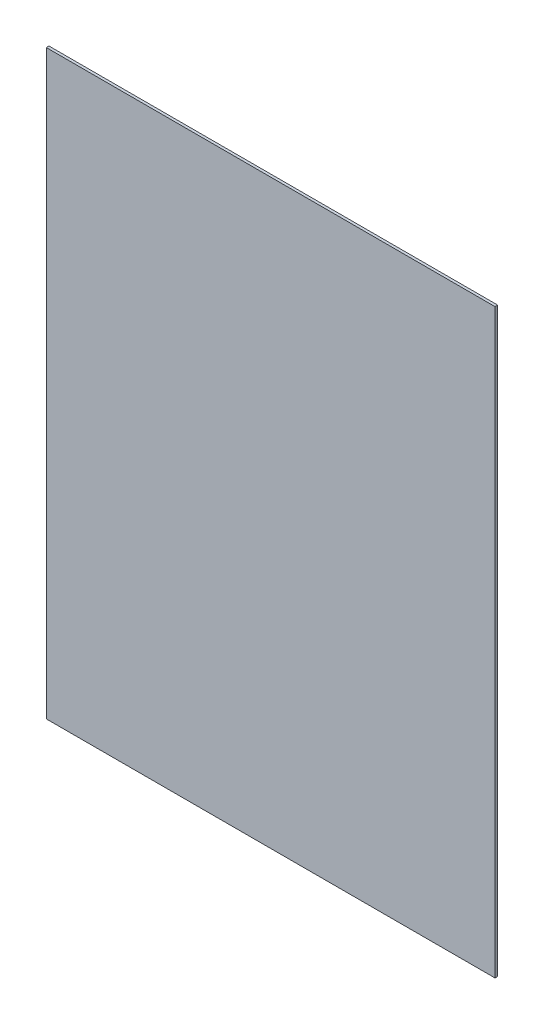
ISO-10303-21;
HEADER;
FILE_DESCRIPTION(('STEP AP214'),'2;1');
FILE_NAME('part.step','',(''),(''),'','','');
FILE_SCHEMA(('AUTOMOTIVE_DESIGN { 1 0 10303 214 1 1 1 1 }'));
ENDSEC;
DATA;
#1=APPLICATION_CONTEXT('core data for automotive mechanical design processes');
#2=APPLICATION_PROTOCOL_DEFINITION('international standard','automotive_design',2000,#1);
#3=PRODUCT_CONTEXT('',#1,'mechanical');
#4=PRODUCT('Part','Part','',(#3));
#5=PRODUCT_RELATED_PRODUCT_CATEGORY('part','',(#4));
#6=PRODUCT_DEFINITION_FORMATION('','',#4);
#7=PRODUCT_DEFINITION_CONTEXT('part definition',#1,'design');
#8=PRODUCT_DEFINITION('design','',#6,#7);
#9=PRODUCT_DEFINITION_SHAPE('','',#8);
#10=(LENGTH_UNIT() NAMED_UNIT(*) SI_UNIT(.MILLI.,.METRE.));
#11=(NAMED_UNIT(*) PLANE_ANGLE_UNIT() SI_UNIT($,.RADIAN.));
#12=(NAMED_UNIT(*) SI_UNIT($,.STERADIAN.) SOLID_ANGLE_UNIT());
#13=UNCERTAINTY_MEASURE_WITH_UNIT(LENGTH_MEASURE(1.E-05),#10,'distance_accuracy_value','');
#14=(GEOMETRIC_REPRESENTATION_CONTEXT(3) GLOBAL_UNCERTAINTY_ASSIGNED_CONTEXT((#13)) GLOBAL_UNIT_ASSIGNED_CONTEXT((#10,
#11,#12)) REPRESENTATION_CONTEXT('',''));
#15=CARTESIAN_POINT('',(0.,0.,0.));
#16=DIRECTION('',(0.,0.,1.));
#17=DIRECTION('',(1.,0.,0.));
#18=AXIS2_PLACEMENT_3D('',#15,#16,#17);
#19=CARTESIAN_POINT('',(0.,0.,3.));
#20=DIRECTION('',(1.,0.,0.));
#21=DIRECTION('',(0.,0.,-1.));
#22=AXIS2_PLACEMENT_3D('',#19,#20,#21);
#23=PLANE('',#22);
#24=DIRECTION('',(0.,-1.,0.));
#25=VECTOR('',#24,1.);
#26=CARTESIAN_POINT('',(0.,0.,0.));
#27=LINE('',#26,#25);
#28=CARTESIAN_POINT('',(0.,655.,0.));
#29=VERTEX_POINT('',#28);
#30=CARTESIAN_POINT('',(0.,0.,0.));
#31=VERTEX_POINT('',#30);
#32=EDGE_CURVE('E113',#29,#31,#27,.T.);
#33=ORIENTED_EDGE('',*,*,#32,.T.);
#34=DIRECTION('',(0.,0.,-1.));
#35=VECTOR('',#34,1.);
#36=CARTESIAN_POINT('',(0.,0.,3.));
#37=LINE('',#36,#35);
#38=CARTESIAN_POINT('',(0.,0.,3.));
#39=VERTEX_POINT('',#38);
#40=EDGE_CURVE('E11',#39,#31,#37,.T.);
#41=ORIENTED_EDGE('',*,*,#40,.F.);
#42=DIRECTION('',(0.,-1.,0.));
#43=VECTOR('',#42,1.);
#44=CARTESIAN_POINT('',(0.,0.,3.));
#45=LINE('',#44,#43);
#46=CARTESIAN_POINT('',(0.,655.,3.));
#47=VERTEX_POINT('',#46);
#48=EDGE_CURVE('E97',#47,#39,#45,.T.);
#49=ORIENTED_EDGE('',*,*,#48,.F.);
#50=DIRECTION('',(0.,0.,-1.));
#51=VECTOR('',#50,1.);
#52=CARTESIAN_POINT('',(0.,655.,3.));
#53=LINE('',#52,#51);
#54=EDGE_CURVE('E109',#47,#29,#53,.T.);
#55=ORIENTED_EDGE('',*,*,#54,.T.);
#56=EDGE_LOOP('',(#33,#41,#49,#55));
#57=FACE_BOUND('',#56,.T.);
#58=ADVANCED_FACE('F45',(#57),#23,.F.);
#59=CARTESIAN_POINT('',(0.,0.,3.));
#60=DIRECTION('',(0.,1.,0.));
#61=DIRECTION('',(0.,0.,1.));
#62=AXIS2_PLACEMENT_3D('',#59,#60,#61);
#63=PLANE('',#62);
#64=DIRECTION('',(1.,0.,0.));
#65=VECTOR('',#64,1.);
#66=CARTESIAN_POINT('',(0.,0.,0.));
#67=LINE('',#66,#65);
#68=CARTESIAN_POINT('',(505.5,0.,0.));
#69=VERTEX_POINT('',#68);
#70=EDGE_CURVE('E102',#31,#69,#67,.T.);
#71=ORIENTED_EDGE('',*,*,#70,.T.);
#72=DIRECTION('',(0.,0.,-1.));
#73=VECTOR('',#72,1.);
#74=CARTESIAN_POINT('',(505.5,0.,3.));
#75=LINE('',#74,#73);
#76=CARTESIAN_POINT('',(505.5,0.,3.));
#77=VERTEX_POINT('',#76);
#78=EDGE_CURVE('E54',#77,#69,#75,.T.);
#79=ORIENTED_EDGE('',*,*,#78,.F.);
#80=DIRECTION('',(1.,0.,0.));
#81=VECTOR('',#80,1.);
#82=CARTESIAN_POINT('',(0.,0.,3.));
#83=LINE('',#82,#81);
#84=EDGE_CURVE('E92',#39,#77,#83,.T.);
#85=ORIENTED_EDGE('',*,*,#84,.F.);
#86=ORIENTED_EDGE('',*,*,#40,.T.);
#87=EDGE_LOOP('',(#71,#79,#85,#86));
#88=FACE_BOUND('',#87,.T.);
#89=ADVANCED_FACE('F101',(#88),#63,.F.);
#90=CARTESIAN_POINT('',(505.5,0.,3.));
#91=DIRECTION('',(-1.,0.,0.));
#92=DIRECTION('',(0.,0.,1.));
#93=AXIS2_PLACEMENT_3D('',#90,#91,#92);
#94=PLANE('',#93);
#95=DIRECTION('',(0.,1.,0.));
#96=VECTOR('',#95,1.);
#97=CARTESIAN_POINT('',(505.5,0.,0.));
#98=LINE('',#97,#96);
#99=CARTESIAN_POINT('',(505.5,655.,0.));
#100=VERTEX_POINT('',#99);
#101=EDGE_CURVE('E79',#69,#100,#98,.T.);
#102=ORIENTED_EDGE('',*,*,#101,.T.);
#103=DIRECTION('',(0.,0.,-1.));
#104=VECTOR('',#103,1.);
#105=CARTESIAN_POINT('',(505.5,655.,3.));
#106=LINE('',#105,#104);
#107=CARTESIAN_POINT('',(505.5,655.,3.));
#108=VERTEX_POINT('',#107);
#109=EDGE_CURVE('E104',#108,#100,#106,.T.);
#110=ORIENTED_EDGE('',*,*,#109,.F.);
#111=DIRECTION('',(0.,1.,0.));
#112=VECTOR('',#111,1.);
#113=CARTESIAN_POINT('',(505.5,0.,3.));
#114=LINE('',#113,#112);
#115=EDGE_CURVE('E95',#77,#108,#114,.T.);
#116=ORIENTED_EDGE('',*,*,#115,.F.);
#117=ORIENTED_EDGE('',*,*,#78,.T.);
#118=EDGE_LOOP('',(#102,#110,#116,#117));
#119=FACE_BOUND('',#118,.T.);
#120=ADVANCED_FACE('F105',(#119),#94,.F.);
#121=CARTESIAN_POINT('',(0.,655.,3.));
#122=DIRECTION('',(0.,-1.,0.));
#123=DIRECTION('',(0.,0.,-1.));
#124=AXIS2_PLACEMENT_3D('',#121,#122,#123);
#125=PLANE('',#124);
#126=DIRECTION('',(-1.,0.,0.));
#127=VECTOR('',#126,1.);
#128=CARTESIAN_POINT('',(0.,655.,0.));
#129=LINE('',#128,#127);
#130=EDGE_CURVE('E85',#100,#29,#129,.T.);
#131=ORIENTED_EDGE('',*,*,#130,.T.);
#132=ORIENTED_EDGE('',*,*,#54,.F.);
#133=DIRECTION('',(-1.,0.,0.));
#134=VECTOR('',#133,1.);
#135=CARTESIAN_POINT('',(0.,655.,3.));
#136=LINE('',#135,#134);
#137=EDGE_CURVE('E62',#108,#47,#136,.T.);
#138=ORIENTED_EDGE('',*,*,#137,.F.);
#139=ORIENTED_EDGE('',*,*,#109,.T.);
#140=EDGE_LOOP('',(#131,#132,#138,#139));
#141=FACE_BOUND('',#140,.T.);
#142=ADVANCED_FACE('F126',(#141),#125,.F.);
#143=CARTESIAN_POINT('',(0.,0.,3.));
#144=DIRECTION('',(0.,0.,-1.));
#145=DIRECTION('',(-1.,0.,0.));
#146=AXIS2_PLACEMENT_3D('',#143,#144,#145);
#147=PLANE('',#146);
#148=ORIENTED_EDGE('',*,*,#48,.T.);
#149=ORIENTED_EDGE('',*,*,#84,.T.);
#150=ORIENTED_EDGE('',*,*,#115,.T.);
#151=ORIENTED_EDGE('',*,*,#137,.T.);
#152=EDGE_LOOP('',(#148,#149,#150,#151));
#153=FACE_BOUND('',#152,.T.);
#154=ADVANCED_FACE('F93',(#153),#147,.F.);
#155=CARTESIAN_POINT('',(0.,0.,0.));
#156=DIRECTION('',(0.,0.,-1.));
#157=DIRECTION('',(-1.,0.,0.));
#158=AXIS2_PLACEMENT_3D('',#155,#156,#157);
#159=PLANE('',#158);
#160=ORIENTED_EDGE('',*,*,#32,.F.);
#161=ORIENTED_EDGE('',*,*,#130,.F.);
#162=ORIENTED_EDGE('',*,*,#101,.F.);
#163=ORIENTED_EDGE('',*,*,#70,.F.);
#164=EDGE_LOOP('',(#160,#161,#162,#163));
#165=FACE_BOUND('',#164,.T.);
#166=ADVANCED_FACE('F129',(#165),#159,.T.);
#167=CLOSED_SHELL('',(#58,#89,#120,#142,#154,#166));
#168=MANIFOLD_SOLID_BREP('B2',#167);
#169=ADVANCED_BREP_SHAPE_REPRESENTATION('',(#18,#168),#14);
#170=SHAPE_DEFINITION_REPRESENTATION(#9,#169);
ENDSEC;
END-ISO-10303-21;
